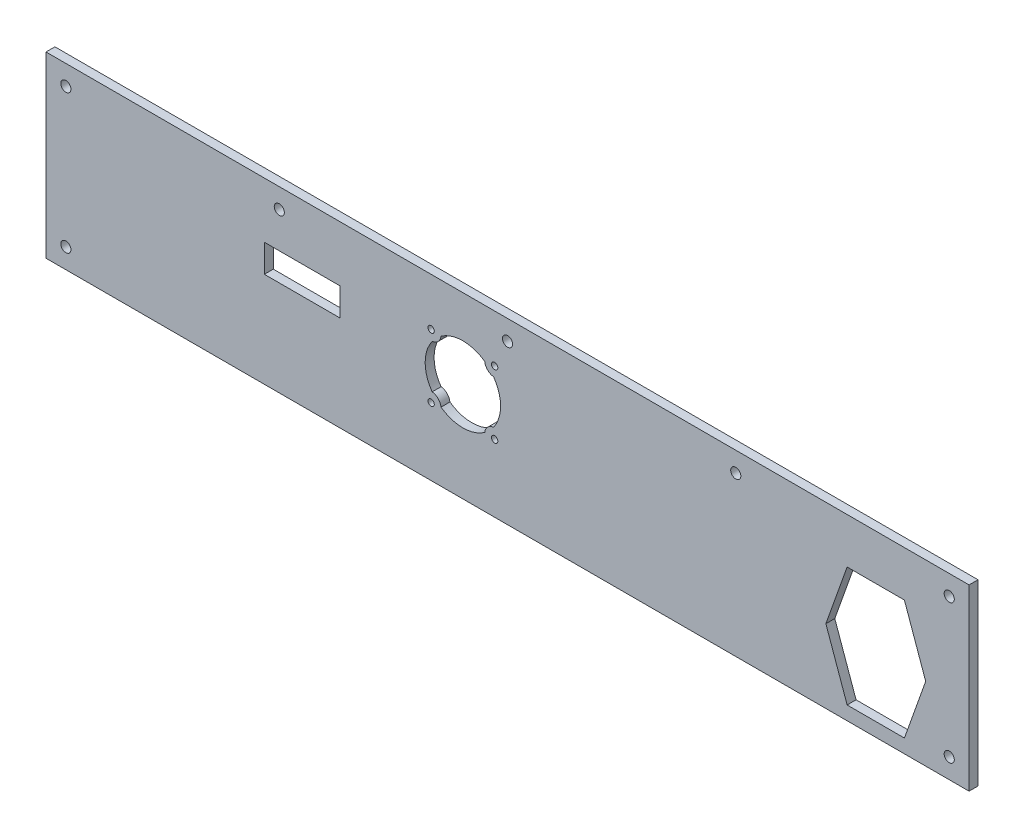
ISO-10303-21;
HEADER;
FILE_DESCRIPTION(('STEP AP214'),'2;1');
FILE_NAME('part.step','',(''),(''),'','','');
FILE_SCHEMA(('AUTOMOTIVE_DESIGN { 1 0 10303 214 1 1 1 1 }'));
ENDSEC;
DATA;
#1=APPLICATION_CONTEXT('core data for automotive mechanical design processes');
#2=APPLICATION_PROTOCOL_DEFINITION('international standard','automotive_design',2000,#1);
#3=PRODUCT_CONTEXT('',#1,'mechanical');
#4=PRODUCT('Part','Part','',(#3));
#5=PRODUCT_RELATED_PRODUCT_CATEGORY('part','',(#4));
#6=PRODUCT_DEFINITION_FORMATION('','',#4);
#7=PRODUCT_DEFINITION_CONTEXT('part definition',#1,'design');
#8=PRODUCT_DEFINITION('design','',#6,#7);
#9=PRODUCT_DEFINITION_SHAPE('','',#8);
#10=(LENGTH_UNIT() NAMED_UNIT(*) SI_UNIT(.MILLI.,.METRE.));
#11=(NAMED_UNIT(*) PLANE_ANGLE_UNIT() SI_UNIT($,.RADIAN.));
#12=(NAMED_UNIT(*) SI_UNIT($,.STERADIAN.) SOLID_ANGLE_UNIT());
#13=UNCERTAINTY_MEASURE_WITH_UNIT(LENGTH_MEASURE(1.E-05),#10,'distance_accuracy_value','');
#14=(GEOMETRIC_REPRESENTATION_CONTEXT(3) GLOBAL_UNCERTAINTY_ASSIGNED_CONTEXT((#13)) GLOBAL_UNIT_ASSIGNED_CONTEXT((#10,
#11,#12)) REPRESENTATION_CONTEXT('',''));
#15=CARTESIAN_POINT('',(0.,0.,0.));
#16=DIRECTION('',(0.,0.,1.));
#17=DIRECTION('',(1.,0.,0.));
#18=AXIS2_PLACEMENT_3D('',#15,#16,#17);
#19=CARTESIAN_POINT('',(0.,1.94289029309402E-13,2.2479));
#20=DIRECTION('',(0.,0.,-1.));
#21=DIRECTION('',(-1.,0.,0.));
#22=AXIS2_PLACEMENT_3D('',#19,#20,#21);
#23=PLANE('',#22);
#24=DIRECTION('',(-0.335324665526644,0.942102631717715,0.));
#25=VECTOR('',#24,1.);
#26=CARTESIAN_POINT('',(210.636873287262,-7.99999999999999,2.2479));
#27=LINE('',#26,#25);
#28=CARTESIAN_POINT('',(210.636873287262,-7.99999999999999,2.2479));
#29=VERTEX_POINT('',#28);
#30=CARTESIAN_POINT('',(199.923313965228,22.1000000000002,2.2479));
#31=VERTEX_POINT('',#30);
#32=EDGE_CURVE('E215',#29,#31,#27,.T.);
#33=ORIENTED_EDGE('',*,*,#32,.F.);
#34=DIRECTION('',(0.335324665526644,0.942102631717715,0.));
#35=VECTOR('',#34,1.);
#36=CARTESIAN_POINT('',(199.923313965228,-38.1,2.2479));
#37=LINE('',#36,#35);
#38=CARTESIAN_POINT('',(199.923313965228,-38.1,2.2479));
#39=VERTEX_POINT('',#38);
#40=EDGE_CURVE('E61',#39,#29,#37,.T.);
#41=ORIENTED_EDGE('',*,*,#40,.F.);
#42=DIRECTION('',(1.,0.,0.));
#43=VECTOR('',#42,1.);
#44=CARTESIAN_POINT('',(171.076686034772,-38.1,2.2479));
#45=LINE('',#44,#43);
#46=CARTESIAN_POINT('',(171.076686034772,-38.1,2.2479));
#47=VERTEX_POINT('',#46);
#48=EDGE_CURVE('E207',#47,#39,#45,.T.);
#49=ORIENTED_EDGE('',*,*,#48,.F.);
#50=DIRECTION('',(0.335324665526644,-0.942102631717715,0.));
#51=VECTOR('',#50,1.);
#52=CARTESIAN_POINT('',(160.363126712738,-7.99999999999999,2.24790000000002));
#53=LINE('',#52,#51);
#54=CARTESIAN_POINT('',(160.363126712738,-7.99999999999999,2.24790000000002));
#55=VERTEX_POINT('',#54);
#56=EDGE_CURVE('E228',#55,#47,#53,.T.);
#57=ORIENTED_EDGE('',*,*,#56,.F.);
#58=DIRECTION('',(-0.335324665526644,-0.942102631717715,0.));
#59=VECTOR('',#58,1.);
#60=CARTESIAN_POINT('',(171.076686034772,22.1000000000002,2.24790000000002));
#61=LINE('',#60,#59);
#62=CARTESIAN_POINT('',(171.076686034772,22.1000000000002,2.24790000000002));
#63=VERTEX_POINT('',#62);
#64=EDGE_CURVE('E225',#63,#55,#61,.T.);
#65=ORIENTED_EDGE('',*,*,#64,.F.);
#66=DIRECTION('',(-1.,0.,0.));
#67=VECTOR('',#66,1.);
#68=CARTESIAN_POINT('',(199.923313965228,22.1000000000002,2.2479));
#69=LINE('',#68,#67);
#70=EDGE_CURVE('E222',#31,#63,#69,.T.);
#71=ORIENTED_EDGE('',*,*,#70,.F.);
#72=EDGE_LOOP('',(#33,#41,#49,#57,#65,#71));
#73=FACE_BOUND('',#72,.T.);
#74=CARTESIAN_POINT('',(-38.5,21.0000000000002,2.2479));
#75=DIRECTION('',(0.,0.,-1.));
#76=DIRECTION('',(1.,0.,0.));
#77=AXIS2_PLACEMENT_3D('',#74,#75,#76);
#78=CIRCLE('',#77,4.99999999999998);
#79=CARTESIAN_POINT('',(-33.5279513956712,20.4720486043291,2.2479));
#80=VERTEX_POINT('',#79);
#81=CARTESIAN_POINT('',(-37.9720486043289,16.0279513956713,2.2479));
#82=VERTEX_POINT('',#81);
#83=EDGE_CURVE('E263',#80,#82,#78,.T.);
#84=ORIENTED_EDGE('',*,*,#83,.F.);
#85=CARTESIAN_POINT('',(-22.4999999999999,5.00000000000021,2.2479));
#86=DIRECTION('',(0.,0.,1.));
#87=DIRECTION('',(1.,0.,0.));
#88=AXIS2_PLACEMENT_3D('',#85,#86,#87);
#89=CIRCLE('',#88,19.);
#90=CARTESIAN_POINT('',(-11.4720486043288,20.4720486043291,2.2479));
#91=VERTEX_POINT('',#90);
#92=EDGE_CURVE('E261',#91,#80,#89,.T.);
#93=ORIENTED_EDGE('',*,*,#92,.F.);
#94=CARTESIAN_POINT('',(-6.49999999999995,21.0000000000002,2.2479));
#95=DIRECTION('',(0.,0.,-1.));
#96=DIRECTION('',(1.,0.,0.));
#97=AXIS2_PLACEMENT_3D('',#94,#95,#96);
#98=CIRCLE('',#97,4.99999999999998);
#99=CARTESIAN_POINT('',(-7.02795139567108,16.0279513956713,2.2479));
#100=VERTEX_POINT('',#99);
#101=EDGE_CURVE('E281',#100,#91,#98,.T.);
#102=ORIENTED_EDGE('',*,*,#101,.F.);
#103=CARTESIAN_POINT('',(-22.4999999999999,5.00000000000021,2.2479));
#104=DIRECTION('',(0.,0.,1.));
#105=DIRECTION('',(1.,0.,0.));
#106=AXIS2_PLACEMENT_3D('',#103,#104,#105);
#107=CIRCLE('',#106,19.);
#108=CARTESIAN_POINT('',(-7.02795139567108,-6.0279513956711,2.2479));
#109=VERTEX_POINT('',#108);
#110=EDGE_CURVE('E278',#109,#100,#107,.T.);
#111=ORIENTED_EDGE('',*,*,#110,.F.);
#112=CARTESIAN_POINT('',(-6.49999999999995,-11.,2.2479));
#113=DIRECTION('',(0.,0.,-1.));
#114=DIRECTION('',(1.,0.,0.));
#115=AXIS2_PLACEMENT_3D('',#112,#113,#114);
#116=CIRCLE('',#115,4.99999999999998);
#117=CARTESIAN_POINT('',(-11.4720486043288,-10.4720486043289,2.2479));
#118=VERTEX_POINT('',#117);
#119=EDGE_CURVE('E275',#118,#109,#116,.T.);
#120=ORIENTED_EDGE('',*,*,#119,.F.);
#121=CARTESIAN_POINT('',(-22.4999999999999,5.00000000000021,2.2479));
#122=DIRECTION('',(0.,0.,1.));
#123=DIRECTION('',(1.,0.,0.));
#124=AXIS2_PLACEMENT_3D('',#121,#122,#123);
#125=CIRCLE('',#124,19.);
#126=CARTESIAN_POINT('',(-33.5279513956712,-10.4720486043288,2.2479));
#127=VERTEX_POINT('',#126);
#128=EDGE_CURVE('E272',#127,#118,#125,.T.);
#129=ORIENTED_EDGE('',*,*,#128,.F.);
#130=CARTESIAN_POINT('',(-38.5,-11.,2.2479));
#131=DIRECTION('',(0.,0.,-1.));
#132=DIRECTION('',(1.,0.,0.));
#133=AXIS2_PLACEMENT_3D('',#130,#131,#132);
#134=CIRCLE('',#133,4.99999999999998);
#135=CARTESIAN_POINT('',(-37.9720486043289,-6.02795139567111,2.2479));
#136=VERTEX_POINT('',#135);
#137=EDGE_CURVE('E269',#136,#127,#134,.T.);
#138=ORIENTED_EDGE('',*,*,#137,.F.);
#139=CARTESIAN_POINT('',(-22.4999999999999,5.00000000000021,2.2479));
#140=DIRECTION('',(0.,0.,1.));
#141=DIRECTION('',(1.,0.,0.));
#142=AXIS2_PLACEMENT_3D('',#139,#140,#141);
#143=CIRCLE('',#142,19.);
#144=EDGE_CURVE('E266',#82,#136,#143,.T.);
#145=ORIENTED_EDGE('',*,*,#144,.F.);
#146=EDGE_LOOP('',(#84,#93,#102,#111,#120,#129,#138,#145));
#147=FACE_BOUND('',#146,.T.);
#148=CARTESIAN_POINT('',(-6.49999999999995,-11.,2.2479));
#149=DIRECTION('',(0.,0.,1.));
#150=DIRECTION('',(1.,0.,0.));
#151=AXIS2_PLACEMENT_3D('',#148,#149,#150);
#152=CIRCLE('',#151,1.59999999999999);
#153=CARTESIAN_POINT('',(-4.89999999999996,-11.,2.2479));
#154=VERTEX_POINT('',#153);
#155=EDGE_CURVE('E305',#154,#154,#152,.T.);
#156=ORIENTED_EDGE('',*,*,#155,.F.);
#157=EDGE_LOOP('',(#156));
#158=FACE_BOUND('',#157,.T.);
#159=CARTESIAN_POINT('',(-38.5,-11.,2.2479));
#160=DIRECTION('',(0.,0.,1.));
#161=DIRECTION('',(1.,0.,0.));
#162=AXIS2_PLACEMENT_3D('',#159,#160,#161);
#163=CIRCLE('',#162,1.59999999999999);
#164=CARTESIAN_POINT('',(-36.9,-11.,2.2479));
#165=VERTEX_POINT('',#164);
#166=EDGE_CURVE('E311',#165,#165,#163,.T.);
#167=ORIENTED_EDGE('',*,*,#166,.F.);
#168=EDGE_LOOP('',(#167));
#169=FACE_BOUND('',#168,.T.);
#170=CARTESIAN_POINT('',(-38.5,21.0000000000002,2.2479));
#171=DIRECTION('',(0.,0.,1.));
#172=DIRECTION('',(1.,0.,0.));
#173=AXIS2_PLACEMENT_3D('',#170,#171,#172);
#174=CIRCLE('',#173,1.59999999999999);
#175=CARTESIAN_POINT('',(-36.9,21.0000000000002,2.2479));
#176=VERTEX_POINT('',#175);
#177=EDGE_CURVE('E317',#176,#176,#174,.T.);
#178=ORIENTED_EDGE('',*,*,#177,.F.);
#179=EDGE_LOOP('',(#178));
#180=FACE_BOUND('',#179,.T.);
#181=CARTESIAN_POINT('',(-6.49999999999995,21.0000000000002,2.2479));
#182=DIRECTION('',(0.,0.,1.));
#183=DIRECTION('',(1.,0.,0.));
#184=AXIS2_PLACEMENT_3D('',#181,#182,#183);
#185=CIRCLE('',#184,1.59999999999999);
#186=CARTESIAN_POINT('',(-4.89999999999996,21.0000000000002,2.2479));
#187=VERTEX_POINT('',#186);
#188=EDGE_CURVE('E323',#187,#187,#185,.T.);
#189=ORIENTED_EDGE('',*,*,#188,.F.);
#190=EDGE_LOOP('',(#189));
#191=FACE_BOUND('',#190,.T.);
#192=DIRECTION('',(1.,0.,0.));
#193=VECTOR('',#192,1.);
#194=CARTESIAN_POINT('',(-122.5,3.00000000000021,2.2479));
#195=LINE('',#194,#193);
#196=CARTESIAN_POINT('',(-122.5,3.00000000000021,2.2479));
#197=VERTEX_POINT('',#196);
#198=CARTESIAN_POINT('',(-84.4999999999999,3.00000000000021,2.2479));
#199=VERTEX_POINT('',#198);
#200=EDGE_CURVE('E339',#197,#199,#195,.T.);
#201=ORIENTED_EDGE('',*,*,#200,.F.);
#202=DIRECTION('',(0.,-1.,0.));
#203=VECTOR('',#202,1.);
#204=CARTESIAN_POINT('',(-122.5,17.0000000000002,2.2479));
#205=LINE('',#204,#203);
#206=CARTESIAN_POINT('',(-122.5,17.0000000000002,2.2479));
#207=VERTEX_POINT('',#206);
#208=EDGE_CURVE('E337',#207,#197,#205,.T.);
#209=ORIENTED_EDGE('',*,*,#208,.F.);
#210=DIRECTION('',(-1.,0.,0.));
#211=VECTOR('',#210,1.);
#212=CARTESIAN_POINT('',(-122.5,17.0000000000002,2.2479));
#213=LINE('',#212,#211);
#214=CARTESIAN_POINT('',(-84.4999999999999,17.0000000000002,2.2479));
#215=VERTEX_POINT('',#214);
#216=EDGE_CURVE('E345',#215,#207,#213,.T.);
#217=ORIENTED_EDGE('',*,*,#216,.F.);
#218=DIRECTION('',(0.,1.,0.));
#219=VECTOR('',#218,1.);
#220=CARTESIAN_POINT('',(-84.4999999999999,17.0000000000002,2.2479));
#221=LINE('',#220,#219);
#222=EDGE_CURVE('E342',#199,#215,#221,.T.);
#223=ORIENTED_EDGE('',*,*,#222,.F.);
#224=EDGE_LOOP('',(#201,#209,#217,#223));
#225=FACE_BOUND('',#224,.T.);
#226=CARTESIAN_POINT('',(222.5,35.,2.2479));
#227=DIRECTION('',(0.,0.,1.));
#228=DIRECTION('',(-1.,0.,0.));
#229=AXIS2_PLACEMENT_3D('',#226,#227,#228);
#230=CIRCLE('',#229,2.54999999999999);
#231=CARTESIAN_POINT('',(219.95,35.,2.2479));
#232=VERTEX_POINT('',#231);
#233=EDGE_CURVE('E367',#232,#232,#230,.T.);
#234=ORIENTED_EDGE('',*,*,#233,.F.);
#235=EDGE_LOOP('',(#234));
#236=FACE_BOUND('',#235,.T.);
#237=CARTESIAN_POINT('',(-114.975,35.,2.2479));
#238=DIRECTION('',(0.,0.,1.));
#239=DIRECTION('',(1.,0.,0.));
#240=AXIS2_PLACEMENT_3D('',#237,#238,#239);
#241=CIRCLE('',#240,2.54999999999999);
#242=CARTESIAN_POINT('',(-112.425,35.,2.2479));
#243=VERTEX_POINT('',#242);
#244=EDGE_CURVE('E379',#243,#243,#241,.T.);
#245=ORIENTED_EDGE('',*,*,#244,.F.);
#246=EDGE_LOOP('',(#245));
#247=FACE_BOUND('',#246,.T.);
#248=CARTESIAN_POINT('',(-222.5,-34.9999999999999,2.2479));
#249=DIRECTION('',(0.,0.,1.));
#250=DIRECTION('',(1.,0.,0.));
#251=AXIS2_PLACEMENT_3D('',#248,#249,#250);
#252=CIRCLE('',#251,2.54999999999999);
#253=CARTESIAN_POINT('',(-219.95,-34.9999999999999,2.2479));
#254=VERTEX_POINT('',#253);
#255=EDGE_CURVE('E391',#254,#254,#252,.T.);
#256=ORIENTED_EDGE('',*,*,#255,.F.);
#257=EDGE_LOOP('',(#256));
#258=FACE_BOUND('',#257,.T.);
#259=DIRECTION('',(0.,1.,0.));
#260=VECTOR('',#259,1.);
#261=CARTESIAN_POINT('',(232.5,-45.,2.2479));
#262=LINE('',#261,#260);
#263=CARTESIAN_POINT('',(232.5,-45.,2.2479));
#264=VERTEX_POINT('',#263);
#265=CARTESIAN_POINT('',(232.5,45.,2.24789999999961));
#266=VERTEX_POINT('',#265);
#267=EDGE_CURVE('E403',#264,#266,#262,.T.);
#268=ORIENTED_EDGE('',*,*,#267,.T.);
#269=DIRECTION('',(-1.,0.,0.));
#270=VECTOR('',#269,1.);
#271=CARTESIAN_POINT('',(-232.5,45.,2.24789999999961));
#272=LINE('',#271,#270);
#273=CARTESIAN_POINT('',(-232.5,45.,2.24789999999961));
#274=VERTEX_POINT('',#273);
#275=EDGE_CURVE('E406',#266,#274,#272,.T.);
#276=ORIENTED_EDGE('',*,*,#275,.T.);
#277=DIRECTION('',(0.,-1.,0.));
#278=VECTOR('',#277,1.);
#279=CARTESIAN_POINT('',(-232.5,-44.9999999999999,2.2479));
#280=LINE('',#279,#278);
#281=CARTESIAN_POINT('',(-232.5,-44.9999999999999,2.2479));
#282=VERTEX_POINT('',#281);
#283=EDGE_CURVE('E409',#274,#282,#280,.T.);
#284=ORIENTED_EDGE('',*,*,#283,.T.);
#285=DIRECTION('',(1.,0.,0.));
#286=VECTOR('',#285,1.);
#287=CARTESIAN_POINT('',(-232.5,-44.9999999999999,2.2479));
#288=LINE('',#287,#286);
#289=EDGE_CURVE('E411',#282,#264,#288,.T.);
#290=ORIENTED_EDGE('',*,*,#289,.T.);
#291=EDGE_LOOP('',(#268,#276,#284,#290));
#292=FACE_BOUND('',#291,.T.);
#293=CARTESIAN_POINT('',(-222.5,35.,2.2479));
#294=DIRECTION('',(0.,0.,1.));
#295=DIRECTION('',(1.,0.,0.));
#296=AXIS2_PLACEMENT_3D('',#293,#294,#295);
#297=CIRCLE('',#296,2.54999999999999);
#298=CARTESIAN_POINT('',(-219.95,35.,2.2479));
#299=VERTEX_POINT('',#298);
#300=EDGE_CURVE('E397',#299,#299,#297,.T.);
#301=ORIENTED_EDGE('',*,*,#300,.F.);
#302=EDGE_LOOP('',(#301));
#303=FACE_BOUND('',#302,.T.);
#304=CARTESIAN_POINT('',(0.,35.,2.2479));
#305=DIRECTION('',(0.,0.,1.));
#306=DIRECTION('',(1.,0.,0.));
#307=AXIS2_PLACEMENT_3D('',#304,#305,#306);
#308=CIRCLE('',#307,2.55);
#309=CARTESIAN_POINT('',(2.55,35.,2.2479));
#310=VERTEX_POINT('',#309);
#311=EDGE_CURVE('E385',#310,#310,#308,.T.);
#312=ORIENTED_EDGE('',*,*,#311,.F.);
#313=EDGE_LOOP('',(#312));
#314=FACE_BOUND('',#313,.T.);
#315=CARTESIAN_POINT('',(222.5,-34.9999999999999,2.2479));
#316=DIRECTION('',(0.,0.,1.));
#317=DIRECTION('',(-1.,0.,0.));
#318=AXIS2_PLACEMENT_3D('',#315,#316,#317);
#319=CIRCLE('',#318,2.54999999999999);
#320=CARTESIAN_POINT('',(219.95,-34.9999999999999,2.2479));
#321=VERTEX_POINT('',#320);
#322=EDGE_CURVE('E373',#321,#321,#319,.T.);
#323=ORIENTED_EDGE('',*,*,#322,.F.);
#324=EDGE_LOOP('',(#323));
#325=FACE_BOUND('',#324,.T.);
#326=CARTESIAN_POINT('',(114.975,35.,2.24789999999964));
#327=DIRECTION('',(0.,0.,1.));
#328=DIRECTION('',(-1.,0.,0.));
#329=AXIS2_PLACEMENT_3D('',#326,#327,#328);
#330=CIRCLE('',#329,2.54999999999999);
#331=CARTESIAN_POINT('',(112.425,35.,2.24789999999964));
#332=VERTEX_POINT('',#331);
#333=EDGE_CURVE('E361',#332,#332,#330,.T.);
#334=ORIENTED_EDGE('',*,*,#333,.F.);
#335=EDGE_LOOP('',(#334));
#336=FACE_BOUND('',#335,.T.);
#337=ADVANCED_FACE('F46',(#73,#147,#158,#169,#180,#191,#225,#236,#247,#258,#292,#303,#314,#325,
#336),#23,.F.);
#338=CARTESIAN_POINT('',(0.,0.,-2.2479));
#339=DIRECTION('',(0.,0.,-1.));
#340=DIRECTION('',(-1.,0.,0.));
#341=AXIS2_PLACEMENT_3D('',#338,#339,#340);
#342=PLANE('',#341);
#343=DIRECTION('',(0.335324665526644,0.942102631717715,0.));
#344=VECTOR('',#343,1.);
#345=CARTESIAN_POINT('',(199.923313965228,-38.1,-2.2479));
#346=LINE('',#345,#344);
#347=CARTESIAN_POINT('',(199.923313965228,-38.1,-2.2479));
#348=VERTEX_POINT('',#347);
#349=CARTESIAN_POINT('',(210.636873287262,-7.9999999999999,-2.2479));
#350=VERTEX_POINT('',#349);
#351=EDGE_CURVE('E205',#348,#350,#346,.T.);
#352=ORIENTED_EDGE('',*,*,#351,.T.);
#353=DIRECTION('',(-0.335324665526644,0.942102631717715,0.));
#354=VECTOR('',#353,1.);
#355=CARTESIAN_POINT('',(210.636873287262,-7.9999999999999,-2.2479));
#356=LINE('',#355,#354);
#357=CARTESIAN_POINT('',(199.923313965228,22.1,-2.2479));
#358=VERTEX_POINT('',#357);
#359=EDGE_CURVE('E194',#350,#358,#356,.T.);
#360=ORIENTED_EDGE('',*,*,#359,.T.);
#361=DIRECTION('',(-1.,0.,0.));
#362=VECTOR('',#361,1.);
#363=CARTESIAN_POINT('',(199.923313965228,22.1,-2.2479));
#364=LINE('',#363,#362);
#365=CARTESIAN_POINT('',(171.076686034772,22.1,-2.2479));
#366=VERTEX_POINT('',#365);
#367=EDGE_CURVE('E710',#358,#366,#364,.T.);
#368=ORIENTED_EDGE('',*,*,#367,.T.);
#369=DIRECTION('',(-0.335324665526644,-0.942102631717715,0.));
#370=VECTOR('',#369,1.);
#371=CARTESIAN_POINT('',(171.076686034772,22.1,-2.2479));
#372=LINE('',#371,#370);
#373=CARTESIAN_POINT('',(160.363126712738,-7.99999999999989,-2.2479));
#374=VERTEX_POINT('',#373);
#375=EDGE_CURVE('E715',#366,#374,#372,.T.);
#376=ORIENTED_EDGE('',*,*,#375,.T.);
#377=DIRECTION('',(0.335324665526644,-0.942102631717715,0.));
#378=VECTOR('',#377,1.);
#379=CARTESIAN_POINT('',(160.363126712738,-7.99999999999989,-2.2479));
#380=LINE('',#379,#378);
#381=CARTESIAN_POINT('',(171.076686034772,-38.1,-2.2479));
#382=VERTEX_POINT('',#381);
#383=EDGE_CURVE('E217',#374,#382,#380,.T.);
#384=ORIENTED_EDGE('',*,*,#383,.T.);
#385=DIRECTION('',(1.,0.,0.));
#386=VECTOR('',#385,1.);
#387=CARTESIAN_POINT('',(171.076686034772,-38.1,-2.2479));
#388=LINE('',#387,#386);
#389=EDGE_CURVE('E213',#382,#348,#388,.T.);
#390=ORIENTED_EDGE('',*,*,#389,.T.);
#391=EDGE_LOOP('',(#352,#360,#368,#376,#384,#390));
#392=FACE_BOUND('',#391,.T.);
#393=CARTESIAN_POINT('',(-22.4999999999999,5.00000000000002,-2.2479));
#394=DIRECTION('',(0.,0.,-1.));
#395=DIRECTION('',(-1.,0.,0.));
#396=AXIS2_PLACEMENT_3D('',#393,#394,#395);
#397=CIRCLE('',#396,19.);
#398=CARTESIAN_POINT('',(-11.4720486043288,20.4720486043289,-2.2479));
#399=VERTEX_POINT('',#398);
#400=CARTESIAN_POINT('',(-33.5279513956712,20.4720486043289,-2.2479));
#401=VERTEX_POINT('',#400);
#402=EDGE_CURVE('E258',#399,#401,#397,.F.);
#403=ORIENTED_EDGE('',*,*,#402,.T.);
#404=CARTESIAN_POINT('',(-38.5,21.,-2.2479));
#405=DIRECTION('',(0.,0.,-1.));
#406=DIRECTION('',(-1.,0.,0.));
#407=AXIS2_PLACEMENT_3D('',#404,#405,#406);
#408=CIRCLE('',#407,4.99999999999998);
#409=CARTESIAN_POINT('',(-37.9720486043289,16.0279513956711,-2.2479));
#410=VERTEX_POINT('',#409);
#411=EDGE_CURVE('E287',#401,#410,#408,.T.);
#412=ORIENTED_EDGE('',*,*,#411,.T.);
#413=CARTESIAN_POINT('',(-22.4999999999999,5.00000000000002,-2.2479));
#414=DIRECTION('',(0.,0.,-1.));
#415=DIRECTION('',(-1.,0.,0.));
#416=AXIS2_PLACEMENT_3D('',#413,#414,#415);
#417=CIRCLE('',#416,19.);
#418=CARTESIAN_POINT('',(-37.9720486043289,-6.0279513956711,-2.2479));
#419=VERTEX_POINT('',#418);
#420=EDGE_CURVE('E201',#410,#419,#417,.F.);
#421=ORIENTED_EDGE('',*,*,#420,.T.);
#422=CARTESIAN_POINT('',(-38.5,-10.9999999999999,-2.2479));
#423=DIRECTION('',(0.,0.,-1.));
#424=DIRECTION('',(-1.,0.,0.));
#425=AXIS2_PLACEMENT_3D('',#422,#423,#424);
#426=CIRCLE('',#425,4.99999999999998);
#427=CARTESIAN_POINT('',(-33.5279513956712,-10.4720486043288,-2.2479));
#428=VERTEX_POINT('',#427);
#429=EDGE_CURVE('E243',#419,#428,#426,.T.);
#430=ORIENTED_EDGE('',*,*,#429,.T.);
#431=CARTESIAN_POINT('',(-22.4999999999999,5.00000000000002,-2.2479));
#432=DIRECTION('',(0.,0.,-1.));
#433=DIRECTION('',(-1.,0.,0.));
#434=AXIS2_PLACEMENT_3D('',#431,#432,#433);
#435=CIRCLE('',#434,19.);
#436=CARTESIAN_POINT('',(-11.4720486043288,-10.4720486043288,-2.2479));
#437=VERTEX_POINT('',#436);
#438=EDGE_CURVE('E246',#428,#437,#435,.F.);
#439=ORIENTED_EDGE('',*,*,#438,.T.);
#440=CARTESIAN_POINT('',(-6.49999999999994,-10.9999999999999,-2.2479));
#441=DIRECTION('',(0.,0.,-1.));
#442=DIRECTION('',(-1.,0.,0.));
#443=AXIS2_PLACEMENT_3D('',#440,#441,#442);
#444=CIRCLE('',#443,4.99999999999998);
#445=CARTESIAN_POINT('',(-7.02795139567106,-6.02795139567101,-2.2479));
#446=VERTEX_POINT('',#445);
#447=EDGE_CURVE('E249',#437,#446,#444,.T.);
#448=ORIENTED_EDGE('',*,*,#447,.T.);
#449=CARTESIAN_POINT('',(-22.4999999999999,5.00000000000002,-2.2479));
#450=DIRECTION('',(0.,0.,-1.));
#451=DIRECTION('',(-1.,0.,0.));
#452=AXIS2_PLACEMENT_3D('',#449,#450,#451);
#453=CIRCLE('',#452,19.);
#454=CARTESIAN_POINT('',(-7.02795139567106,16.0279513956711,-2.2479));
#455=VERTEX_POINT('',#454);
#456=EDGE_CURVE('E252',#446,#455,#453,.F.);
#457=ORIENTED_EDGE('',*,*,#456,.T.);
#458=CARTESIAN_POINT('',(-6.49999999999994,21.,-2.24790000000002));
#459=DIRECTION('',(0.,0.,-1.));
#460=DIRECTION('',(-1.,0.,0.));
#461=AXIS2_PLACEMENT_3D('',#458,#459,#460);
#462=CIRCLE('',#461,4.99999999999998);
#463=EDGE_CURVE('E255',#455,#399,#462,.T.);
#464=ORIENTED_EDGE('',*,*,#463,.T.);
#465=EDGE_LOOP('',(#403,#412,#421,#430,#439,#448,#457,#464));
#466=FACE_BOUND('',#465,.T.);
#467=CARTESIAN_POINT('',(-6.49999999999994,-10.9999999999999,-2.2479));
#468=DIRECTION('',(0.,0.,-1.));
#469=DIRECTION('',(-1.,0.,0.));
#470=AXIS2_PLACEMENT_3D('',#467,#468,#469);
#471=CIRCLE('',#470,1.59999999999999);
#472=CARTESIAN_POINT('',(-8.09999999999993,-10.9999999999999,-2.2479));
#473=VERTEX_POINT('',#472);
#474=EDGE_CURVE('E304',#473,#473,#471,.F.);
#475=ORIENTED_EDGE('',*,*,#474,.T.);
#476=EDGE_LOOP('',(#475));
#477=FACE_BOUND('',#476,.T.);
#478=CARTESIAN_POINT('',(-38.5,-10.9999999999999,-2.2479));
#479=DIRECTION('',(0.,0.,-1.));
#480=DIRECTION('',(-1.,0.,0.));
#481=AXIS2_PLACEMENT_3D('',#478,#479,#480);
#482=CIRCLE('',#481,1.59999999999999);
#483=CARTESIAN_POINT('',(-40.1,-10.9999999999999,-2.2479));
#484=VERTEX_POINT('',#483);
#485=EDGE_CURVE('E308',#484,#484,#482,.F.);
#486=ORIENTED_EDGE('',*,*,#485,.T.);
#487=EDGE_LOOP('',(#486));
#488=FACE_BOUND('',#487,.T.);
#489=CARTESIAN_POINT('',(-38.5,21.,-2.2479));
#490=DIRECTION('',(0.,0.,-1.));
#491=DIRECTION('',(-1.,0.,0.));
#492=AXIS2_PLACEMENT_3D('',#489,#490,#491);
#493=CIRCLE('',#492,1.59999999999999);
#494=CARTESIAN_POINT('',(-40.1,21.,-2.2479));
#495=VERTEX_POINT('',#494);
#496=EDGE_CURVE('E314',#495,#495,#493,.F.);
#497=ORIENTED_EDGE('',*,*,#496,.T.);
#498=EDGE_LOOP('',(#497));
#499=FACE_BOUND('',#498,.T.);
#500=CARTESIAN_POINT('',(-6.49999999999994,21.,-2.24790000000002));
#501=DIRECTION('',(0.,0.,-1.));
#502=DIRECTION('',(-1.,0.,0.));
#503=AXIS2_PLACEMENT_3D('',#500,#501,#502);
#504=CIRCLE('',#503,1.59999999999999);
#505=CARTESIAN_POINT('',(-8.09999999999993,21.,-2.24790000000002));
#506=VERTEX_POINT('',#505);
#507=EDGE_CURVE('E320',#506,#506,#504,.F.);
#508=ORIENTED_EDGE('',*,*,#507,.T.);
#509=EDGE_LOOP('',(#508));
#510=FACE_BOUND('',#509,.T.);
#511=DIRECTION('',(0.,-1.,0.));
#512=VECTOR('',#511,1.);
#513=CARTESIAN_POINT('',(-122.5,17.,-2.2479));
#514=LINE('',#513,#512);
#515=CARTESIAN_POINT('',(-122.5,17.,-2.2479));
#516=VERTEX_POINT('',#515);
#517=CARTESIAN_POINT('',(-122.5,3.00000000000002,-2.2479));
#518=VERTEX_POINT('',#517);
#519=EDGE_CURVE('E334',#516,#518,#514,.T.);
#520=ORIENTED_EDGE('',*,*,#519,.T.);
#521=DIRECTION('',(1.,0.,0.));
#522=VECTOR('',#521,1.);
#523=CARTESIAN_POINT('',(-122.5,3.00000000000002,-2.2479));
#524=LINE('',#523,#522);
#525=CARTESIAN_POINT('',(-84.4999999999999,3.00000000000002,-2.24790000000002));
#526=VERTEX_POINT('',#525);
#527=EDGE_CURVE('E351',#518,#526,#524,.T.);
#528=ORIENTED_EDGE('',*,*,#527,.T.);
#529=DIRECTION('',(0.,1.,0.));
#530=VECTOR('',#529,1.);
#531=CARTESIAN_POINT('',(-84.4999999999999,17.,-2.2479));
#532=LINE('',#531,#530);
#533=CARTESIAN_POINT('',(-84.4999999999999,17.,-2.2479));
#534=VERTEX_POINT('',#533);
#535=EDGE_CURVE('E326',#526,#534,#532,.T.);
#536=ORIENTED_EDGE('',*,*,#535,.T.);
#537=DIRECTION('',(-1.,0.,0.));
#538=VECTOR('',#537,1.);
#539=CARTESIAN_POINT('',(-122.5,17.,-2.2479));
#540=LINE('',#539,#538);
#541=EDGE_CURVE('E331',#534,#516,#540,.T.);
#542=ORIENTED_EDGE('',*,*,#541,.T.);
#543=EDGE_LOOP('',(#520,#528,#536,#542));
#544=FACE_BOUND('',#543,.T.);
#545=CARTESIAN_POINT('',(222.5,35.,-2.2479));
#546=DIRECTION('',(0.,0.,1.));
#547=DIRECTION('',(-1.,0.,0.));
#548=AXIS2_PLACEMENT_3D('',#545,#546,#547);
#549=CIRCLE('',#548,2.54999999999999);
#550=CARTESIAN_POINT('',(219.95,35.,-2.2479));
#551=VERTEX_POINT('',#550);
#552=EDGE_CURVE('E364',#551,#551,#549,.T.);
#553=ORIENTED_EDGE('',*,*,#552,.T.);
#554=EDGE_LOOP('',(#553));
#555=FACE_BOUND('',#554,.T.);
#556=CARTESIAN_POINT('',(-114.975,35.,-2.2479));
#557=DIRECTION('',(0.,0.,1.));
#558=DIRECTION('',(1.,0.,0.));
#559=AXIS2_PLACEMENT_3D('',#556,#557,#558);
#560=CIRCLE('',#559,2.54999999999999);
#561=CARTESIAN_POINT('',(-112.425,35.,-2.2479));
#562=VERTEX_POINT('',#561);
#563=EDGE_CURVE('E376',#562,#562,#560,.T.);
#564=ORIENTED_EDGE('',*,*,#563,.T.);
#565=EDGE_LOOP('',(#564));
#566=FACE_BOUND('',#565,.T.);
#567=CARTESIAN_POINT('',(-222.5,-34.9999999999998,-2.2479));
#568=DIRECTION('',(0.,0.,1.));
#569=DIRECTION('',(1.,0.,0.));
#570=AXIS2_PLACEMENT_3D('',#567,#568,#569);
#571=CIRCLE('',#570,2.54999999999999);
#572=CARTESIAN_POINT('',(-219.95,-34.9999999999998,-2.2479));
#573=VERTEX_POINT('',#572);
#574=EDGE_CURVE('E388',#573,#573,#571,.T.);
#575=ORIENTED_EDGE('',*,*,#574,.T.);
#576=EDGE_LOOP('',(#575));
#577=FACE_BOUND('',#576,.T.);
#578=DIRECTION('',(0.,1.,0.));
#579=VECTOR('',#578,1.);
#580=CARTESIAN_POINT('',(232.5,-45.,-2.2479));
#581=LINE('',#580,#579);
#582=CARTESIAN_POINT('',(232.5,-45.,-2.2479));
#583=VERTEX_POINT('',#582);
#584=CARTESIAN_POINT('',(232.5,45.,-2.24790000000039));
#585=VERTEX_POINT('',#584);
#586=EDGE_CURVE('E400',#583,#585,#581,.T.);
#587=ORIENTED_EDGE('',*,*,#586,.F.);
#588=DIRECTION('',(1.,0.,0.));
#589=VECTOR('',#588,1.);
#590=CARTESIAN_POINT('',(-232.5,-44.9999999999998,-2.2479));
#591=LINE('',#590,#589);
#592=CARTESIAN_POINT('',(-232.5,-44.9999999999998,-2.2479));
#593=VERTEX_POINT('',#592);
#594=EDGE_CURVE('E407',#593,#583,#591,.T.);
#595=ORIENTED_EDGE('',*,*,#594,.F.);
#596=DIRECTION('',(0.,-1.,0.));
#597=VECTOR('',#596,1.);
#598=CARTESIAN_POINT('',(-232.5,-44.9999999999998,-2.2479));
#599=LINE('',#598,#597);
#600=CARTESIAN_POINT('',(-232.5,45.,-2.24790000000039));
#601=VERTEX_POINT('',#600);
#602=EDGE_CURVE('E418',#601,#593,#599,.T.);
#603=ORIENTED_EDGE('',*,*,#602,.F.);
#604=DIRECTION('',(-1.,0.,0.));
#605=VECTOR('',#604,1.);
#606=CARTESIAN_POINT('',(-232.5,45.,-2.24790000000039));
#607=LINE('',#606,#605);
#608=EDGE_CURVE('E416',#585,#601,#607,.T.);
#609=ORIENTED_EDGE('',*,*,#608,.F.);
#610=EDGE_LOOP('',(#587,#595,#603,#609));
#611=FACE_BOUND('',#610,.T.);
#612=CARTESIAN_POINT('',(-222.5,35.,-2.2479));
#613=DIRECTION('',(0.,0.,1.));
#614=DIRECTION('',(1.,0.,0.));
#615=AXIS2_PLACEMENT_3D('',#612,#613,#614);
#616=CIRCLE('',#615,2.54999999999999);
#617=CARTESIAN_POINT('',(-219.95,35.,-2.2479));
#618=VERTEX_POINT('',#617);
#619=EDGE_CURVE('E394',#618,#618,#616,.T.);
#620=ORIENTED_EDGE('',*,*,#619,.T.);
#621=EDGE_LOOP('',(#620));
#622=FACE_BOUND('',#621,.T.);
#623=CARTESIAN_POINT('',(0.,35.,-2.2479));
#624=DIRECTION('',(0.,0.,1.));
#625=DIRECTION('',(1.,0.,0.));
#626=AXIS2_PLACEMENT_3D('',#623,#624,#625);
#627=CIRCLE('',#626,2.55);
#628=CARTESIAN_POINT('',(2.55,35.,-2.2479));
#629=VERTEX_POINT('',#628);
#630=EDGE_CURVE('E382',#629,#629,#627,.T.);
#631=ORIENTED_EDGE('',*,*,#630,.T.);
#632=EDGE_LOOP('',(#631));
#633=FACE_BOUND('',#632,.T.);
#634=CARTESIAN_POINT('',(222.5,-34.9999999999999,-2.2479));
#635=DIRECTION('',(0.,0.,1.));
#636=DIRECTION('',(-1.,0.,0.));
#637=AXIS2_PLACEMENT_3D('',#634,#635,#636);
#638=CIRCLE('',#637,2.54999999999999);
#639=CARTESIAN_POINT('',(219.95,-34.9999999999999,-2.2479));
#640=VERTEX_POINT('',#639);
#641=EDGE_CURVE('E370',#640,#640,#638,.T.);
#642=ORIENTED_EDGE('',*,*,#641,.T.);
#643=EDGE_LOOP('',(#642));
#644=FACE_BOUND('',#643,.T.);
#645=CARTESIAN_POINT('',(114.975,35.,-2.24790000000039));
#646=DIRECTION('',(0.,0.,1.));
#647=DIRECTION('',(-1.,0.,0.));
#648=AXIS2_PLACEMENT_3D('',#645,#646,#647);
#649=CIRCLE('',#648,2.54999999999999);
#650=CARTESIAN_POINT('',(112.425,35.,-2.24790000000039));
#651=VERTEX_POINT('',#650);
#652=EDGE_CURVE('E360',#651,#651,#649,.T.);
#653=ORIENTED_EDGE('',*,*,#652,.T.);
#654=EDGE_LOOP('',(#653));
#655=FACE_BOUND('',#654,.T.);
#656=ADVANCED_FACE('F210',(#392,#466,#477,#488,#499,#510,#544,#555,#566,#577,#611,#622,#633,
#644,#655),#342,.T.);
#657=CARTESIAN_POINT('',(232.5,-45.,2.2479));
#658=DIRECTION('',(-1.,0.,0.));
#659=DIRECTION('',(0.,0.,1.));
#660=AXIS2_PLACEMENT_3D('',#657,#658,#659);
#661=PLANE('',#660);
#662=ORIENTED_EDGE('',*,*,#586,.T.);
#663=DIRECTION('',(0.,0.,-1.));
#664=VECTOR('',#663,1.);
#665=CARTESIAN_POINT('',(232.5,45.,2.24789999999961));
#666=LINE('',#665,#664);
#667=EDGE_CURVE('E13',#266,#585,#666,.T.);
#668=ORIENTED_EDGE('',*,*,#667,.F.);
#669=ORIENTED_EDGE('',*,*,#267,.F.);
#670=DIRECTION('',(0.,0.,-1.));
#671=VECTOR('',#670,1.);
#672=CARTESIAN_POINT('',(232.5,-45.,2.2479));
#673=LINE('',#672,#671);
#674=EDGE_CURVE('E413',#264,#583,#673,.T.);
#675=ORIENTED_EDGE('',*,*,#674,.T.);
#676=EDGE_LOOP('',(#662,#668,#669,#675));
#677=FACE_BOUND('',#676,.T.);
#678=ADVANCED_FACE('F48',(#677),#661,.F.);
#679=CARTESIAN_POINT('',(-232.5,45.,2.24789999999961));
#680=DIRECTION('',(0.,-1.,0.));
#681=DIRECTION('',(0.,0.,-1.));
#682=AXIS2_PLACEMENT_3D('',#679,#680,#681);
#683=PLANE('',#682);
#684=ORIENTED_EDGE('',*,*,#608,.T.);
#685=DIRECTION('',(0.,0.,-1.));
#686=VECTOR('',#685,1.);
#687=CARTESIAN_POINT('',(-232.5,45.,2.24789999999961));
#688=LINE('',#687,#686);
#689=EDGE_CURVE('E54',#274,#601,#688,.T.);
#690=ORIENTED_EDGE('',*,*,#689,.F.);
#691=ORIENTED_EDGE('',*,*,#275,.F.);
#692=ORIENTED_EDGE('',*,*,#667,.T.);
#693=EDGE_LOOP('',(#684,#690,#691,#692));
#694=FACE_BOUND('',#693,.T.);
#695=ADVANCED_FACE('F446',(#694),#683,.F.);
#696=CARTESIAN_POINT('',(-232.5,-44.9999999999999,2.2479));
#697=DIRECTION('',(1.,0.,0.));
#698=DIRECTION('',(0.,0.,-1.));
#699=AXIS2_PLACEMENT_3D('',#696,#697,#698);
#700=PLANE('',#699);
#701=ORIENTED_EDGE('',*,*,#602,.T.);
#702=DIRECTION('',(0.,0.,-1.));
#703=VECTOR('',#702,1.);
#704=CARTESIAN_POINT('',(-232.5,-44.9999999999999,2.2479));
#705=LINE('',#704,#703);
#706=EDGE_CURVE('E423',#282,#593,#705,.T.);
#707=ORIENTED_EDGE('',*,*,#706,.F.);
#708=ORIENTED_EDGE('',*,*,#283,.F.);
#709=ORIENTED_EDGE('',*,*,#689,.T.);
#710=EDGE_LOOP('',(#701,#707,#708,#709));
#711=FACE_BOUND('',#710,.T.);
#712=ADVANCED_FACE('F430',(#711),#700,.F.);
#713=CARTESIAN_POINT('',(-232.5,-44.9999999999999,2.2479));
#714=DIRECTION('',(0.,1.,0.));
#715=DIRECTION('',(0.,0.,1.));
#716=AXIS2_PLACEMENT_3D('',#713,#714,#715);
#717=PLANE('',#716);
#718=ORIENTED_EDGE('',*,*,#594,.T.);
#719=ORIENTED_EDGE('',*,*,#674,.F.);
#720=ORIENTED_EDGE('',*,*,#289,.F.);
#721=ORIENTED_EDGE('',*,*,#706,.T.);
#722=EDGE_LOOP('',(#718,#719,#720,#721));
#723=FACE_BOUND('',#722,.T.);
#724=ADVANCED_FACE('F439',(#723),#717,.F.);
#725=CARTESIAN_POINT('',(-222.5,35.,2.2479));
#726=DIRECTION('',(0.,0.,-1.));
#727=DIRECTION('',(-1.,0.,0.));
#728=AXIS2_PLACEMENT_3D('',#725,#726,#727);
#729=CYLINDRICAL_SURFACE('',#728,2.54999999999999);
#730=ORIENTED_EDGE('',*,*,#300,.T.);
#731=EDGE_LOOP('',(#730));
#732=FACE_BOUND('',#731,.T.);
#733=ORIENTED_EDGE('',*,*,#619,.F.);
#734=EDGE_LOOP('',(#733));
#735=FACE_BOUND('',#734,.T.);
#736=ADVANCED_FACE('F462',(#732,#735),#729,.F.);
#737=CARTESIAN_POINT('',(-222.5,-34.9999999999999,2.2479));
#738=DIRECTION('',(0.,0.,-1.));
#739=DIRECTION('',(-1.,0.,0.));
#740=AXIS2_PLACEMENT_3D('',#737,#738,#739);
#741=CYLINDRICAL_SURFACE('',#740,2.54999999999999);
#742=ORIENTED_EDGE('',*,*,#255,.T.);
#743=EDGE_LOOP('',(#742));
#744=FACE_BOUND('',#743,.T.);
#745=ORIENTED_EDGE('',*,*,#574,.F.);
#746=EDGE_LOOP('',(#745));
#747=FACE_BOUND('',#746,.T.);
#748=ADVANCED_FACE('F469',(#744,#747),#741,.F.);
#749=CARTESIAN_POINT('',(0.,35.,2.2479));
#750=DIRECTION('',(0.,0.,-1.));
#751=DIRECTION('',(-1.,0.,0.));
#752=AXIS2_PLACEMENT_3D('',#749,#750,#751);
#753=CYLINDRICAL_SURFACE('',#752,2.55);
#754=ORIENTED_EDGE('',*,*,#311,.T.);
#755=EDGE_LOOP('',(#754));
#756=FACE_BOUND('',#755,.T.);
#757=ORIENTED_EDGE('',*,*,#630,.F.);
#758=EDGE_LOOP('',(#757));
#759=FACE_BOUND('',#758,.T.);
#760=ADVANCED_FACE('F474',(#756,#759),#753,.F.);
#761=CARTESIAN_POINT('',(-114.975,35.,2.2479));
#762=DIRECTION('',(0.,0.,-1.));
#763=DIRECTION('',(-1.,0.,0.));
#764=AXIS2_PLACEMENT_3D('',#761,#762,#763);
#765=CYLINDRICAL_SURFACE('',#764,2.54999999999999);
#766=ORIENTED_EDGE('',*,*,#244,.T.);
#767=EDGE_LOOP('',(#766));
#768=FACE_BOUND('',#767,.T.);
#769=ORIENTED_EDGE('',*,*,#563,.F.);
#770=EDGE_LOOP('',(#769));
#771=FACE_BOUND('',#770,.T.);
#772=ADVANCED_FACE('F506',(#768,#771),#765,.F.);
#773=CARTESIAN_POINT('',(222.5,-34.9999999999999,2.2479));
#774=DIRECTION('',(0.,0.,-1.));
#775=DIRECTION('',(-1.,0.,0.));
#776=AXIS2_PLACEMENT_3D('',#773,#774,#775);
#777=CYLINDRICAL_SURFACE('',#776,2.54999999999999);
#778=ORIENTED_EDGE('',*,*,#322,.T.);
#779=EDGE_LOOP('',(#778));
#780=FACE_BOUND('',#779,.T.);
#781=ORIENTED_EDGE('',*,*,#641,.F.);
#782=EDGE_LOOP('',(#781));
#783=FACE_BOUND('',#782,.T.);
#784=ADVANCED_FACE('F499',(#780,#783),#777,.F.);
#785=CARTESIAN_POINT('',(222.5,35.,2.2479));
#786=DIRECTION('',(0.,0.,-1.));
#787=DIRECTION('',(-1.,0.,0.));
#788=AXIS2_PLACEMENT_3D('',#785,#786,#787);
#789=CYLINDRICAL_SURFACE('',#788,2.54999999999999);
#790=ORIENTED_EDGE('',*,*,#233,.T.);
#791=EDGE_LOOP('',(#790));
#792=FACE_BOUND('',#791,.T.);
#793=ORIENTED_EDGE('',*,*,#552,.F.);
#794=EDGE_LOOP('',(#793));
#795=FACE_BOUND('',#794,.T.);
#796=ADVANCED_FACE('F489',(#792,#795),#789,.F.);
#797=CARTESIAN_POINT('',(114.975,35.,2.24789999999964));
#798=DIRECTION('',(0.,0.,-1.));
#799=DIRECTION('',(-1.,0.,0.));
#800=AXIS2_PLACEMENT_3D('',#797,#798,#799);
#801=CYLINDRICAL_SURFACE('',#800,2.54999999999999);
#802=ORIENTED_EDGE('',*,*,#333,.T.);
#803=EDGE_LOOP('',(#802));
#804=FACE_BOUND('',#803,.T.);
#805=ORIENTED_EDGE('',*,*,#652,.F.);
#806=EDGE_LOOP('',(#805));
#807=FACE_BOUND('',#806,.T.);
#808=ADVANCED_FACE('F486',(#804,#807),#801,.F.);
#809=CARTESIAN_POINT('',(-122.5,17.,-2.2489));
#810=DIRECTION('',(-1.,0.,0.));
#811=DIRECTION('',(0.,0.,1.));
#812=AXIS2_PLACEMENT_3D('',#809,#810,#811);
#813=PLANE('',#812);
#814=DIRECTION('',(0.,0.,1.));
#815=VECTOR('',#814,1.);
#816=CARTESIAN_POINT('',(-122.5,17.,-2.2489));
#817=LINE('',#816,#815);
#818=EDGE_CURVE('E349',#516,#207,#817,.T.);
#819=ORIENTED_EDGE('',*,*,#818,.T.);
#820=ORIENTED_EDGE('',*,*,#208,.T.);
#821=DIRECTION('',(0.,0.,1.));
#822=VECTOR('',#821,1.);
#823=CARTESIAN_POINT('',(-122.5,3.00000000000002,-2.2489));
#824=LINE('',#823,#822);
#825=EDGE_CURVE('E348',#518,#197,#824,.T.);
#826=ORIENTED_EDGE('',*,*,#825,.F.);
#827=ORIENTED_EDGE('',*,*,#519,.F.);
#828=EDGE_LOOP('',(#819,#820,#826,#827));
#829=FACE_BOUND('',#828,.T.);
#830=ADVANCED_FACE('F488',(#829),#813,.F.);
#831=CARTESIAN_POINT('',(-122.5,17.,-2.2489));
#832=DIRECTION('',(0.,1.,0.));
#833=DIRECTION('',(0.,0.,1.));
#834=AXIS2_PLACEMENT_3D('',#831,#832,#833);
#835=PLANE('',#834);
#836=DIRECTION('',(0.,0.,1.));
#837=VECTOR('',#836,1.);
#838=CARTESIAN_POINT('',(-84.4999999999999,17.,-2.2489));
#839=LINE('',#838,#837);
#840=EDGE_CURVE('E352',#534,#215,#839,.T.);
#841=ORIENTED_EDGE('',*,*,#840,.T.);
#842=ORIENTED_EDGE('',*,*,#216,.T.);
#843=ORIENTED_EDGE('',*,*,#818,.F.);
#844=ORIENTED_EDGE('',*,*,#541,.F.);
#845=EDGE_LOOP('',(#841,#842,#843,#844));
#846=FACE_BOUND('',#845,.T.);
#847=ADVANCED_FACE('F496',(#846),#835,.F.);
#848=CARTESIAN_POINT('',(-84.4999999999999,17.,-2.2489));
#849=DIRECTION('',(1.,0.,0.));
#850=DIRECTION('',(0.,0.,-1.));
#851=AXIS2_PLACEMENT_3D('',#848,#849,#850);
#852=PLANE('',#851);
#853=DIRECTION('',(0.,0.,1.));
#854=VECTOR('',#853,1.);
#855=CARTESIAN_POINT('',(-84.4999999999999,3.00000000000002,-2.24890000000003));
#856=LINE('',#855,#854);
#857=EDGE_CURVE('E354',#526,#199,#856,.T.);
#858=ORIENTED_EDGE('',*,*,#857,.T.);
#859=ORIENTED_EDGE('',*,*,#222,.T.);
#860=ORIENTED_EDGE('',*,*,#840,.F.);
#861=ORIENTED_EDGE('',*,*,#535,.F.);
#862=EDGE_LOOP('',(#858,#859,#860,#861));
#863=FACE_BOUND('',#862,.T.);
#864=ADVANCED_FACE('F550',(#863),#852,.F.);
#865=CARTESIAN_POINT('',(-122.5,3.00000000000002,-2.2489));
#866=DIRECTION('',(0.,-1.,0.));
#867=DIRECTION('',(0.,0.,-1.));
#868=AXIS2_PLACEMENT_3D('',#865,#866,#867);
#869=PLANE('',#868);
#870=ORIENTED_EDGE('',*,*,#825,.T.);
#871=ORIENTED_EDGE('',*,*,#200,.T.);
#872=ORIENTED_EDGE('',*,*,#857,.F.);
#873=ORIENTED_EDGE('',*,*,#527,.F.);
#874=EDGE_LOOP('',(#870,#871,#872,#873));
#875=FACE_BOUND('',#874,.T.);
#876=ADVANCED_FACE('F558',(#875),#869,.F.);
#877=CARTESIAN_POINT('',(-6.49999999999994,21.,-2.2489));
#878=DIRECTION('',(0.,0.,1.));
#879=DIRECTION('',(1.,0.,0.));
#880=AXIS2_PLACEMENT_3D('',#877,#878,#879);
#881=CYLINDRICAL_SURFACE('',#880,1.59999999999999);
#882=ORIENTED_EDGE('',*,*,#507,.F.);
#883=EDGE_LOOP('',(#882));
#884=FACE_BOUND('',#883,.T.);
#885=ORIENTED_EDGE('',*,*,#188,.T.);
#886=EDGE_LOOP('',(#885));
#887=FACE_BOUND('',#886,.T.);
#888=ADVANCED_FACE('F566',(#884,#887),#881,.F.);
#889=CARTESIAN_POINT('',(-38.5,21.,-2.2489));
#890=DIRECTION('',(0.,0.,1.));
#891=DIRECTION('',(1.,0.,0.));
#892=AXIS2_PLACEMENT_3D('',#889,#890,#891);
#893=CYLINDRICAL_SURFACE('',#892,1.59999999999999);
#894=ORIENTED_EDGE('',*,*,#496,.F.);
#895=EDGE_LOOP('',(#894));
#896=FACE_BOUND('',#895,.T.);
#897=ORIENTED_EDGE('',*,*,#177,.T.);
#898=EDGE_LOOP('',(#897));
#899=FACE_BOUND('',#898,.T.);
#900=ADVANCED_FACE('F573',(#896,#899),#893,.F.);
#901=CARTESIAN_POINT('',(-38.5,-10.9999999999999,-2.2489));
#902=DIRECTION('',(0.,0.,1.));
#903=DIRECTION('',(1.,0.,0.));
#904=AXIS2_PLACEMENT_3D('',#901,#902,#903);
#905=CYLINDRICAL_SURFACE('',#904,1.59999999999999);
#906=ORIENTED_EDGE('',*,*,#485,.F.);
#907=EDGE_LOOP('',(#906));
#908=FACE_BOUND('',#907,.T.);
#909=ORIENTED_EDGE('',*,*,#166,.T.);
#910=EDGE_LOOP('',(#909));
#911=FACE_BOUND('',#910,.T.);
#912=ADVANCED_FACE('F581',(#908,#911),#905,.F.);
#913=CARTESIAN_POINT('',(-6.49999999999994,-10.9999999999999,-2.2489));
#914=DIRECTION('',(0.,0.,1.));
#915=DIRECTION('',(1.,0.,0.));
#916=AXIS2_PLACEMENT_3D('',#913,#914,#915);
#917=CYLINDRICAL_SURFACE('',#916,1.59999999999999);
#918=ORIENTED_EDGE('',*,*,#474,.F.);
#919=EDGE_LOOP('',(#918));
#920=FACE_BOUND('',#919,.T.);
#921=ORIENTED_EDGE('',*,*,#155,.T.);
#922=EDGE_LOOP('',(#921));
#923=FACE_BOUND('',#922,.T.);
#924=ADVANCED_FACE('F589',(#920,#923),#917,.F.);
#925=CARTESIAN_POINT('',(-22.4999999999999,5.00000000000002,-2.2489));
#926=DIRECTION('',(0.,0.,1.));
#927=DIRECTION('',(1.,0.,0.));
#928=AXIS2_PLACEMENT_3D('',#925,#926,#927);
#929=CYLINDRICAL_SURFACE('',#928,19.);
#930=DIRECTION('',(0.,0.,1.));
#931=VECTOR('',#930,1.);
#932=CARTESIAN_POINT('',(-11.4720486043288,20.4720486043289,-2.2489));
#933=LINE('',#932,#931);
#934=EDGE_CURVE('E285',#399,#91,#933,.T.);
#935=ORIENTED_EDGE('',*,*,#934,.T.);
#936=ORIENTED_EDGE('',*,*,#92,.T.);
#937=DIRECTION('',(0.,0.,1.));
#938=VECTOR('',#937,1.);
#939=CARTESIAN_POINT('',(-33.5279513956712,20.4720486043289,-2.2489));
#940=LINE('',#939,#938);
#941=EDGE_CURVE('E284',#401,#80,#940,.T.);
#942=ORIENTED_EDGE('',*,*,#941,.F.);
#943=ORIENTED_EDGE('',*,*,#402,.F.);
#944=EDGE_LOOP('',(#935,#936,#942,#943));
#945=FACE_BOUND('',#944,.T.);
#946=ADVANCED_FACE('F597',(#945),#929,.F.);
#947=CARTESIAN_POINT('',(-6.49999999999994,21.,-2.2489));
#948=DIRECTION('',(0.,0.,1.));
#949=DIRECTION('',(1.,0.,0.));
#950=AXIS2_PLACEMENT_3D('',#947,#948,#949);
#951=CYLINDRICAL_SURFACE('',#950,4.99999999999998);
#952=DIRECTION('',(0.,0.,1.));
#953=VECTOR('',#952,1.);
#954=CARTESIAN_POINT('',(-7.02795139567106,16.0279513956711,-2.2489));
#955=LINE('',#954,#953);
#956=EDGE_CURVE('E288',#455,#100,#955,.T.);
#957=ORIENTED_EDGE('',*,*,#956,.T.);
#958=ORIENTED_EDGE('',*,*,#101,.T.);
#959=ORIENTED_EDGE('',*,*,#934,.F.);
#960=ORIENTED_EDGE('',*,*,#463,.F.);
#961=EDGE_LOOP('',(#957,#958,#959,#960));
#962=FACE_BOUND('',#961,.T.);
#963=ADVANCED_FACE('F605',(#962),#951,.T.);
#964=CARTESIAN_POINT('',(-22.4999999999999,5.00000000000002,-2.2489));
#965=DIRECTION('',(0.,0.,1.));
#966=DIRECTION('',(1.,0.,0.));
#967=AXIS2_PLACEMENT_3D('',#964,#965,#966);
#968=CYLINDRICAL_SURFACE('',#967,19.);
#969=DIRECTION('',(0.,0.,1.));
#970=VECTOR('',#969,1.);
#971=CARTESIAN_POINT('',(-7.02795139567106,-6.02795139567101,-2.2489));
#972=LINE('',#971,#970);
#973=EDGE_CURVE('E290',#446,#109,#972,.T.);
#974=ORIENTED_EDGE('',*,*,#973,.T.);
#975=ORIENTED_EDGE('',*,*,#110,.T.);
#976=ORIENTED_EDGE('',*,*,#956,.F.);
#977=ORIENTED_EDGE('',*,*,#456,.F.);
#978=EDGE_LOOP('',(#974,#975,#976,#977));
#979=FACE_BOUND('',#978,.T.);
#980=ADVANCED_FACE('F613',(#979),#968,.F.);
#981=CARTESIAN_POINT('',(-6.49999999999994,-10.9999999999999,-2.2489));
#982=DIRECTION('',(0.,0.,1.));
#983=DIRECTION('',(1.,0.,0.));
#984=AXIS2_PLACEMENT_3D('',#981,#982,#983);
#985=CYLINDRICAL_SURFACE('',#984,4.99999999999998);
#986=DIRECTION('',(0.,0.,1.));
#987=VECTOR('',#986,1.);
#988=CARTESIAN_POINT('',(-11.4720486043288,-10.4720486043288,-2.2489));
#989=LINE('',#988,#987);
#990=EDGE_CURVE('E292',#437,#118,#989,.T.);
#991=ORIENTED_EDGE('',*,*,#990,.T.);
#992=ORIENTED_EDGE('',*,*,#119,.T.);
#993=ORIENTED_EDGE('',*,*,#973,.F.);
#994=ORIENTED_EDGE('',*,*,#447,.F.);
#995=EDGE_LOOP('',(#991,#992,#993,#994));
#996=FACE_BOUND('',#995,.T.);
#997=ADVANCED_FACE('F621',(#996),#985,.T.);
#998=CARTESIAN_POINT('',(-22.4999999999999,5.00000000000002,-2.2489));
#999=DIRECTION('',(0.,0.,1.));
#1000=DIRECTION('',(1.,0.,0.));
#1001=AXIS2_PLACEMENT_3D('',#998,#999,#1000);
#1002=CYLINDRICAL_SURFACE('',#1001,19.);
#1003=DIRECTION('',(0.,0.,1.));
#1004=VECTOR('',#1003,1.);
#1005=CARTESIAN_POINT('',(-33.5279513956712,-10.4720486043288,-2.2489));
#1006=LINE('',#1005,#1004);
#1007=EDGE_CURVE('E294',#428,#127,#1006,.T.);
#1008=ORIENTED_EDGE('',*,*,#1007,.T.);
#1009=ORIENTED_EDGE('',*,*,#128,.T.);
#1010=ORIENTED_EDGE('',*,*,#990,.F.);
#1011=ORIENTED_EDGE('',*,*,#438,.F.);
#1012=EDGE_LOOP('',(#1008,#1009,#1010,#1011));
#1013=FACE_BOUND('',#1012,.T.);
#1014=ADVANCED_FACE('F629',(#1013),#1002,.F.);
#1015=CARTESIAN_POINT('',(-38.5,-10.9999999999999,-2.2489));
#1016=DIRECTION('',(0.,0.,1.));
#1017=DIRECTION('',(1.,0.,0.));
#1018=AXIS2_PLACEMENT_3D('',#1015,#1016,#1017);
#1019=CYLINDRICAL_SURFACE('',#1018,4.99999999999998);
#1020=DIRECTION('',(0.,0.,1.));
#1021=VECTOR('',#1020,1.);
#1022=CARTESIAN_POINT('',(-37.9720486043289,-6.02795139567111,-2.2489));
#1023=LINE('',#1022,#1021);
#1024=EDGE_CURVE('E296',#419,#136,#1023,.T.);
#1025=ORIENTED_EDGE('',*,*,#1024,.T.);
#1026=ORIENTED_EDGE('',*,*,#137,.T.);
#1027=ORIENTED_EDGE('',*,*,#1007,.F.);
#1028=ORIENTED_EDGE('',*,*,#429,.F.);
#1029=EDGE_LOOP('',(#1025,#1026,#1027,#1028));
#1030=FACE_BOUND('',#1029,.T.);
#1031=ADVANCED_FACE('F637',(#1030),#1019,.T.);
#1032=CARTESIAN_POINT('',(-22.4999999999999,5.00000000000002,-2.2489));
#1033=DIRECTION('',(0.,0.,1.));
#1034=DIRECTION('',(1.,0.,0.));
#1035=AXIS2_PLACEMENT_3D('',#1032,#1033,#1034);
#1036=CYLINDRICAL_SURFACE('',#1035,19.);
#1037=DIRECTION('',(0.,0.,1.));
#1038=VECTOR('',#1037,1.);
#1039=CARTESIAN_POINT('',(-37.9720486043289,16.0279513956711,-2.2489));
#1040=LINE('',#1039,#1038);
#1041=EDGE_CURVE('E298',#410,#82,#1040,.T.);
#1042=ORIENTED_EDGE('',*,*,#1041,.T.);
#1043=ORIENTED_EDGE('',*,*,#144,.T.);
#1044=ORIENTED_EDGE('',*,*,#1024,.F.);
#1045=ORIENTED_EDGE('',*,*,#420,.F.);
#1046=EDGE_LOOP('',(#1042,#1043,#1044,#1045));
#1047=FACE_BOUND('',#1046,.T.);
#1048=ADVANCED_FACE('F645',(#1047),#1036,.F.);
#1049=CARTESIAN_POINT('',(-38.5,21.,-2.2489));
#1050=DIRECTION('',(0.,0.,1.));
#1051=DIRECTION('',(1.,0.,0.));
#1052=AXIS2_PLACEMENT_3D('',#1049,#1050,#1051);
#1053=CYLINDRICAL_SURFACE('',#1052,4.99999999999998);
#1054=ORIENTED_EDGE('',*,*,#941,.T.);
#1055=ORIENTED_EDGE('',*,*,#83,.T.);
#1056=ORIENTED_EDGE('',*,*,#1041,.F.);
#1057=ORIENTED_EDGE('',*,*,#411,.F.);
#1058=EDGE_LOOP('',(#1054,#1055,#1056,#1057));
#1059=FACE_BOUND('',#1058,.T.);
#1060=ADVANCED_FACE('F653',(#1059),#1053,.T.);
#1061=CARTESIAN_POINT('',(199.923313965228,-38.1,-2.2489));
#1062=DIRECTION('',(0.942102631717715,-0.335324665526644,0.));
#1063=DIRECTION('',(0.335324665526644,0.942102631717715,0.));
#1064=AXIS2_PLACEMENT_3D('',#1061,#1062,#1063);
#1065=PLANE('',#1064);
#1066=DIRECTION('',(0.,0.,1.));
#1067=VECTOR('',#1066,1.);
#1068=CARTESIAN_POINT('',(199.923313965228,-38.1,-2.2489));
#1069=LINE('',#1068,#1067);
#1070=EDGE_CURVE('E202',#348,#39,#1069,.T.);
#1071=ORIENTED_EDGE('',*,*,#1070,.T.);
#1072=ORIENTED_EDGE('',*,*,#40,.T.);
#1073=DIRECTION('',(0.,0.,1.));
#1074=VECTOR('',#1073,1.);
#1075=CARTESIAN_POINT('',(210.636873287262,-7.9999999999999,-2.2489));
#1076=LINE('',#1075,#1074);
#1077=EDGE_CURVE('E196',#350,#29,#1076,.T.);
#1078=ORIENTED_EDGE('',*,*,#1077,.F.);
#1079=ORIENTED_EDGE('',*,*,#351,.F.);
#1080=EDGE_LOOP('',(#1071,#1072,#1078,#1079));
#1081=FACE_BOUND('',#1080,.T.);
#1082=ADVANCED_FACE('F204',(#1081),#1065,.F.);
#1083=CARTESIAN_POINT('',(171.076686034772,-38.1,-2.2489));
#1084=DIRECTION('',(0.,-1.,0.));
#1085=DIRECTION('',(0.,0.,-1.));
#1086=AXIS2_PLACEMENT_3D('',#1083,#1084,#1085);
#1087=PLANE('',#1086);
#1088=DIRECTION('',(0.,0.,1.));
#1089=VECTOR('',#1088,1.);
#1090=CARTESIAN_POINT('',(171.076686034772,-38.1,-2.2489));
#1091=LINE('',#1090,#1089);
#1092=EDGE_CURVE('E234',#382,#47,#1091,.T.);
#1093=ORIENTED_EDGE('',*,*,#1092,.T.);
#1094=ORIENTED_EDGE('',*,*,#48,.T.);
#1095=ORIENTED_EDGE('',*,*,#1070,.F.);
#1096=ORIENTED_EDGE('',*,*,#389,.F.);
#1097=EDGE_LOOP('',(#1093,#1094,#1095,#1096));
#1098=FACE_BOUND('',#1097,.T.);
#1099=ADVANCED_FACE('F668',(#1098),#1087,.F.);
#1100=CARTESIAN_POINT('',(160.363126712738,-7.99999999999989,-2.2489));
#1101=DIRECTION('',(-0.942102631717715,-0.335324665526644,0.));
#1102=DIRECTION('',(0.335324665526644,-0.942102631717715,0.));
#1103=AXIS2_PLACEMENT_3D('',#1100,#1101,#1102);
#1104=PLANE('',#1103);
#1105=DIRECTION('',(0.,0.,1.));
#1106=VECTOR('',#1105,1.);
#1107=CARTESIAN_POINT('',(160.363126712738,-7.99999999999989,-2.2489));
#1108=LINE('',#1107,#1106);
#1109=EDGE_CURVE('E236',#374,#55,#1108,.T.);
#1110=ORIENTED_EDGE('',*,*,#1109,.T.);
#1111=ORIENTED_EDGE('',*,*,#56,.T.);
#1112=ORIENTED_EDGE('',*,*,#1092,.F.);
#1113=ORIENTED_EDGE('',*,*,#383,.F.);
#1114=EDGE_LOOP('',(#1110,#1111,#1112,#1113));
#1115=FACE_BOUND('',#1114,.T.);
#1116=ADVANCED_FACE('F675',(#1115),#1104,.F.);
#1117=CARTESIAN_POINT('',(171.076686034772,22.1,-2.2489));
#1118=DIRECTION('',(-0.942102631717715,0.335324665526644,0.));
#1119=DIRECTION('',(-0.335324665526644,-0.942102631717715,0.));
#1120=AXIS2_PLACEMENT_3D('',#1117,#1118,#1119);
#1121=PLANE('',#1120);
#1122=DIRECTION('',(0.,0.,1.));
#1123=VECTOR('',#1122,1.);
#1124=CARTESIAN_POINT('',(171.076686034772,22.1,-2.2489));
#1125=LINE('',#1124,#1123);
#1126=EDGE_CURVE('E238',#366,#63,#1125,.T.);
#1127=ORIENTED_EDGE('',*,*,#1126,.T.);
#1128=ORIENTED_EDGE('',*,*,#64,.T.);
#1129=ORIENTED_EDGE('',*,*,#1109,.F.);
#1130=ORIENTED_EDGE('',*,*,#375,.F.);
#1131=EDGE_LOOP('',(#1127,#1128,#1129,#1130));
#1132=FACE_BOUND('',#1131,.T.);
#1133=ADVANCED_FACE('F683',(#1132),#1121,.F.);
#1134=CARTESIAN_POINT('',(199.923313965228,22.1,-2.2489));
#1135=DIRECTION('',(0.,1.,0.));
#1136=DIRECTION('',(0.,0.,1.));
#1137=AXIS2_PLACEMENT_3D('',#1134,#1135,#1136);
#1138=PLANE('',#1137);
#1139=DIRECTION('',(0.,0.,1.));
#1140=VECTOR('',#1139,1.);
#1141=CARTESIAN_POINT('',(199.923313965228,22.1,-2.2489));
#1142=LINE('',#1141,#1140);
#1143=EDGE_CURVE('E69',#358,#31,#1142,.T.);
#1144=ORIENTED_EDGE('',*,*,#1143,.T.);
#1145=ORIENTED_EDGE('',*,*,#70,.T.);
#1146=ORIENTED_EDGE('',*,*,#1126,.F.);
#1147=ORIENTED_EDGE('',*,*,#367,.F.);
#1148=EDGE_LOOP('',(#1144,#1145,#1146,#1147));
#1149=FACE_BOUND('',#1148,.T.);
#1150=ADVANCED_FACE('F691',(#1149),#1138,.F.);
#1151=CARTESIAN_POINT('',(210.636873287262,-7.9999999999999,-2.2489));
#1152=DIRECTION('',(0.942102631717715,0.335324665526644,0.));
#1153=DIRECTION('',(-0.335324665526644,0.942102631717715,0.));
#1154=AXIS2_PLACEMENT_3D('',#1151,#1152,#1153);
#1155=PLANE('',#1154);
#1156=ORIENTED_EDGE('',*,*,#1077,.T.);
#1157=ORIENTED_EDGE('',*,*,#32,.T.);
#1158=ORIENTED_EDGE('',*,*,#1143,.F.);
#1159=ORIENTED_EDGE('',*,*,#359,.F.);
#1160=EDGE_LOOP('',(#1156,#1157,#1158,#1159));
#1161=FACE_BOUND('',#1160,.T.);
#1162=ADVANCED_FACE('F195',(#1161),#1155,.F.);
#1163=CLOSED_SHELL('',(#337,#656,#678,#695,#712,#724,#736,#748,#760,#772,#784,#796,#808,#830,
#847,#864,#876,#888,#900,#912,#924,#946,#963,#980,#997,#1014,#1031,#1048,#1060,#1082,#1099,
#1116,#1133,#1150,#1162));
#1164=MANIFOLD_SOLID_BREP('B2',#1163);
#1165=ADVANCED_BREP_SHAPE_REPRESENTATION('',(#18,#1164),#14);
#1166=SHAPE_DEFINITION_REPRESENTATION(#9,#1165);
ENDSEC;
END-ISO-10303-21;
